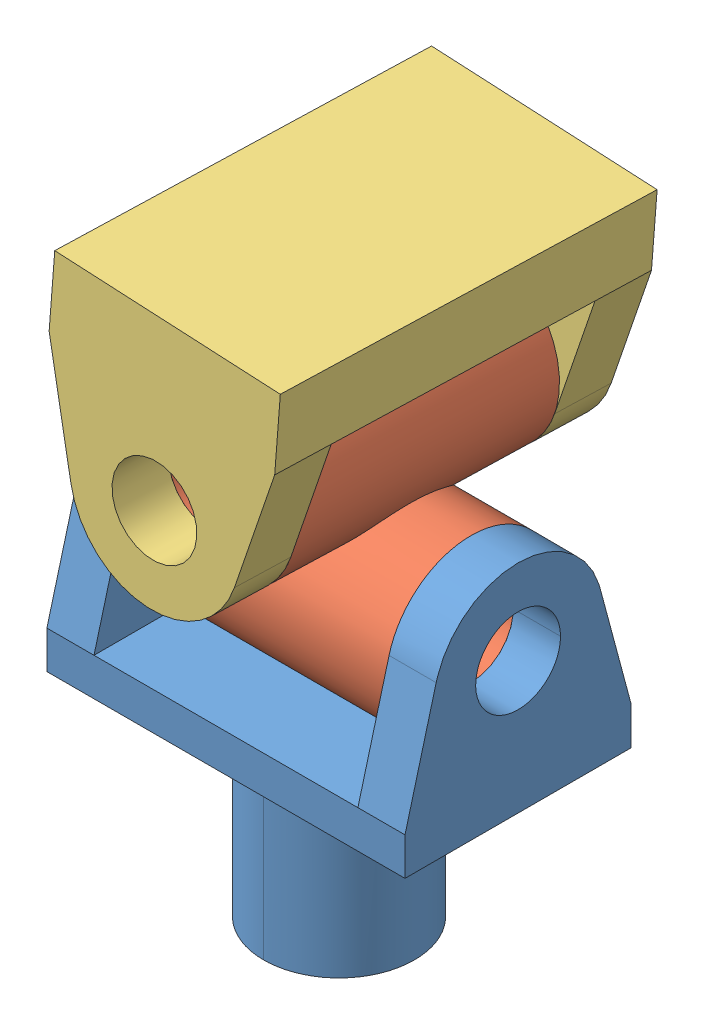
SolidWorks assembly universal joint 3d.SLDASM, configuration Default (file format 9000). Lengths in mm.
Overall size (38 65.16 40.8).
3 component instances, 3 part files, 4 mates.
Components (placement in the parent):
- Cap-1: Cap.sldprt [Default] at (2.5989 40.9638 15.0393) size (38 42 24)
- Part52-1: Part52.SLDPRT [Default] at (2.5989 54.9638 15.0393) x (0 0.999559 -0.029678) z (0 -0.029678 -0.999559) size (31.5 28 28)
- Part6-1: Part6.SLDPRT [Default] at (3.4724 85.9283 14.1199) x (0 -0.029678 -0.999559) z (-0.998753 0.049895 -0.001481) size (40 26.5 24)
Mates (geometry in assembly coordinates):
- Width2: width anti-aligned: plane of Part6-1 through (2.5989 83.0363 29.467) normal (0 -0.029678 -0.999559); plane of Part6-1 through (2.5989 82.2053 1.4793) normal (0 0.029678 0.999559); plane of Part52-1 through (2.5989 83.0363 29.467) normal (0 0.029678 0.999559); plane of Part52-1 through (2.5989 91.2013 1.2122) normal (0 -0.029678 -0.999559)
- Concentric2: concentric aligned: cylinder of Part52-1 through (2.5989 83.0363 29.467) axis (0 0.029678 0.999559) radius 4.5; cylinder of Part6-1 through (2.5989 83.2143 35.4643) axis (0 0.029678 0.999559) radius 4.5
- Coincident1: coincident anti-aligned: plane of Cap-1 through (16.5989 64.0525 3.0393) normal (-1 0 0); plane of Part52-1 through (16.5989 55.2309 24.0354) normal (1 0 0)
- Concentric4: concentric aligned: cylinder of Cap-1 through (-11.4011 54.9638 15.0393) axis (-1 0 0) radius 4.5; cylinder of Part52-1 through (-11.4011 54.9638 15.0393) axis (-1 0 0) radius 4.5
